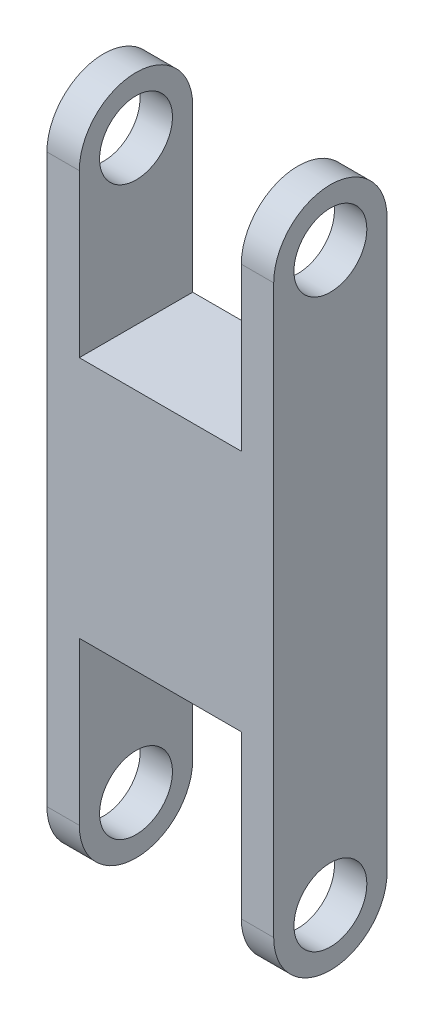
from build123d import *

# Parameters (mm, degrees)
SKETCH2_R           = 22.5
BOSS_EXTRUDE1_DEPTH = 20
SKETCH3_W           = 70
SKETCH3_H           = 150
BOSS_EXTRUDE2_DEPTH = 50
BOSS_EXTRUDE3_START = 20
SKETCH4_R           = 22.5
BOSS_EXTRUDE3_DEPTH = 20


with BuildPart() as part:
    # Sketch2 → Boss-Extrude1 (new body)
    with BuildSketch(Plane(origin=(0, 0, 0), x_dir=(0, 0, -1), z_dir=(1, 0, 0))):
        with BuildLine():
            Line((0, 175), (0, -175))
            ThreePointArc((0, -175), (35, -210), (70, -175))
            Line((70, -175), (70, 175))
            ThreePointArc((70, 175), (35, 210), (0, 175))
        make_face()
        with Locations((35, 175)):
            Circle(SKETCH2_R, mode=Mode.SUBTRACT)
        with Locations((35, -175)):
            Circle(SKETCH2_R, mode=Mode.SUBTRACT)
    extrude(amount=BOSS_EXTRUDE1_DEPTH)

    # Sketch3 → Boss-Extrude2 (add)
    with BuildSketch(Plane.ZY):
        with Locations((-35, 0)):
            Rectangle(SKETCH3_W, SKETCH3_H)
    boss_extrude2 = extrude(amount=BOSS_EXTRUDE2_DEPTH)

    # Mirror5: Boss-Extrude2 across plane
    add(boss_extrude2.mirror(Plane(origin=(-50, 0, 0), x_dir=(0, 0, 1), z_dir=(1, 0, 0))))

    # Sketch4 → Boss-Extrude3 (add)
    with BuildSketch(Plane.ZY.offset(100).offset(BOSS_EXTRUDE3_START)):
        with BuildLine():
            Line((-70, -175), (-70, 175))
            ThreePointArc((-70, 175), (-35, 210), (0, 175))
            Line((0, 175), (0, -175))
            ThreePointArc((0, -175), (-35, -210), (-70, -175))
        make_face()
        with Locations(Location((-35, 175, 0), (0, 0, 180))):
            Circle(SKETCH4_R, mode=Mode.SUBTRACT)
        with Locations(Location((-35, -175, 0), (0, 0, 180))):
            Circle(SKETCH4_R, mode=Mode.SUBTRACT)
    extrude(amount=-BOSS_EXTRUDE3_DEPTH)


solid = part.part
